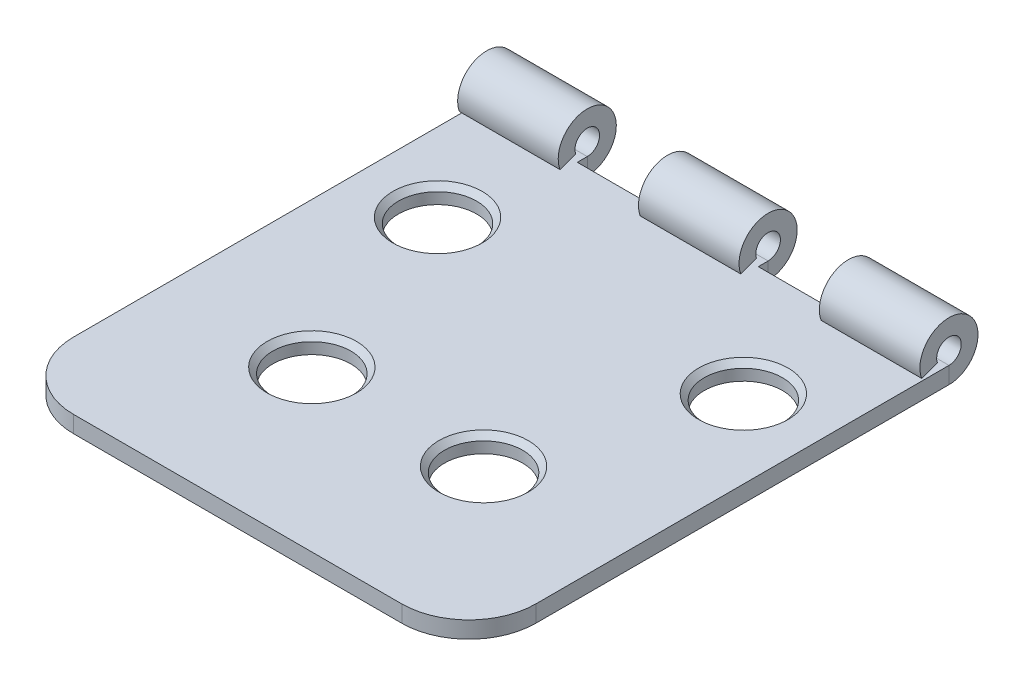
ISO-10303-21;
HEADER;
FILE_DESCRIPTION(('STEP AP214'),'2;1');
FILE_NAME('part.step','',(''),(''),'','','');
FILE_SCHEMA(('AUTOMOTIVE_DESIGN { 1 0 10303 214 1 1 1 1 }'));
ENDSEC;
DATA;
#1=APPLICATION_CONTEXT('core data for automotive mechanical design processes');
#2=APPLICATION_PROTOCOL_DEFINITION('international standard','automotive_design',2000,#1);
#3=PRODUCT_CONTEXT('',#1,'mechanical');
#4=PRODUCT('Part','Part','',(#3));
#5=PRODUCT_RELATED_PRODUCT_CATEGORY('part','',(#4));
#6=PRODUCT_DEFINITION_FORMATION('','',#4);
#7=PRODUCT_DEFINITION_CONTEXT('part definition',#1,'design');
#8=PRODUCT_DEFINITION('design','',#6,#7);
#9=PRODUCT_DEFINITION_SHAPE('','',#8);
#10=(LENGTH_UNIT() NAMED_UNIT(*) SI_UNIT(.MILLI.,.METRE.));
#11=(NAMED_UNIT(*) PLANE_ANGLE_UNIT() SI_UNIT($,.RADIAN.));
#12=(NAMED_UNIT(*) SI_UNIT($,.STERADIAN.) SOLID_ANGLE_UNIT());
#13=UNCERTAINTY_MEASURE_WITH_UNIT(LENGTH_MEASURE(1.E-05),#10,'distance_accuracy_value','');
#14=(GEOMETRIC_REPRESENTATION_CONTEXT(3) GLOBAL_UNCERTAINTY_ASSIGNED_CONTEXT((#13)) GLOBAL_UNIT_ASSIGNED_CONTEXT((#10,
#11,#12)) REPRESENTATION_CONTEXT('',''));
#15=CARTESIAN_POINT('',(0.,0.,0.));
#16=DIRECTION('',(0.,0.,1.));
#17=DIRECTION('',(1.,0.,0.));
#18=AXIS2_PLACEMENT_3D('',#15,#16,#17);
#19=CARTESIAN_POINT('',(9.57958122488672,-0.484575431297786,-6.62388353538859));
#20=DIRECTION('',(0.,1.,0.));
#21=DIRECTION('',(0.,0.,1.));
#22=AXIS2_PLACEMENT_3D('',#19,#20,#21);
#23=CONICAL_SURFACE('',#22,2.45,0.785398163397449);
#24=CARTESIAN_POINT('',(9.57958122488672,-0.134575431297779,-6.62388353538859));
#25=DIRECTION('',(0.,-1.,0.));
#26=DIRECTION('',(0.,0.,-1.));
#27=AXIS2_PLACEMENT_3D('',#24,#25,#26);
#28=CIRCLE('',#27,2.80000000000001);
#29=CARTESIAN_POINT('',(9.57958122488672,-0.134575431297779,-9.4238835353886));
#30=VERTEX_POINT('',#29);
#31=EDGE_CURVE('E321',#30,#30,#28,.T.);
#32=ORIENTED_EDGE('',*,*,#31,.F.);
#33=EDGE_LOOP('',(#32));
#34=FACE_BOUND('',#33,.T.);
#35=CARTESIAN_POINT('',(9.57958122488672,-0.484575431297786,-6.62388353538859));
#36=DIRECTION('',(0.,-1.,0.));
#37=DIRECTION('',(0.,0.,-1.));
#38=AXIS2_PLACEMENT_3D('',#35,#36,#37);
#39=CIRCLE('',#38,2.45);
#40=CARTESIAN_POINT('',(9.57958122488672,-0.484575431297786,-9.07388353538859));
#41=VERTEX_POINT('',#40);
#42=EDGE_CURVE('E386',#41,#41,#39,.F.);
#43=ORIENTED_EDGE('',*,*,#42,.F.);
#44=EDGE_LOOP('',(#43));
#45=FACE_BOUND('',#44,.T.);
#46=ADVANCED_FACE('F54',(#34,#45),#23,.F.);
#47=CARTESIAN_POINT('',(5.37958122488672,-0.484575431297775,5.45125859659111));
#48=DIRECTION('',(0.,1.,0.));
#49=DIRECTION('',(0.,0.,1.));
#50=AXIS2_PLACEMENT_3D('',#47,#48,#49);
#51=CONICAL_SURFACE('',#50,2.45,0.78539816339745);
#52=CARTESIAN_POINT('',(5.37958122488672,-0.134575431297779,5.45125859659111));
#53=DIRECTION('',(0.,-1.,0.));
#54=DIRECTION('',(0.,0.,-1.));
#55=AXIS2_PLACEMENT_3D('',#52,#53,#54);
#56=CIRCLE('',#55,2.8);
#57=CARTESIAN_POINT('',(5.37958122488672,-0.134575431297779,2.65125859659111));
#58=VERTEX_POINT('',#57);
#59=EDGE_CURVE('E324',#58,#58,#56,.T.);
#60=ORIENTED_EDGE('',*,*,#59,.F.);
#61=EDGE_LOOP('',(#60));
#62=FACE_BOUND('',#61,.T.);
#63=CARTESIAN_POINT('',(5.37958122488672,-0.484575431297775,5.45125859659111));
#64=DIRECTION('',(0.,-1.,0.));
#65=DIRECTION('',(0.,0.,-1.));
#66=AXIS2_PLACEMENT_3D('',#63,#64,#65);
#67=CIRCLE('',#66,2.45);
#68=CARTESIAN_POINT('',(5.37958122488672,-0.484575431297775,3.00125859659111));
#69=VERTEX_POINT('',#68);
#70=EDGE_CURVE('E389',#69,#69,#67,.F.);
#71=ORIENTED_EDGE('',*,*,#70,.F.);
#72=EDGE_LOOP('',(#71));
#73=FACE_BOUND('',#72,.T.);
#74=ADVANCED_FACE('F442',(#62,#73),#51,.F.);
#75=CARTESIAN_POINT('',(-5.37941877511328,-0.484575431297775,5.45125859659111));
#76=DIRECTION('',(0.,1.,0.));
#77=DIRECTION('',(0.,0.,1.));
#78=AXIS2_PLACEMENT_3D('',#75,#76,#77);
#79=CONICAL_SURFACE('',#78,2.45,0.78539816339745);
#80=CARTESIAN_POINT('',(-5.37941877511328,-0.134575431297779,5.45125859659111));
#81=DIRECTION('',(0.,-1.,0.));
#82=DIRECTION('',(0.,0.,-1.));
#83=AXIS2_PLACEMENT_3D('',#80,#81,#82);
#84=CIRCLE('',#83,2.8);
#85=CARTESIAN_POINT('',(-5.37941877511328,-0.134575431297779,2.65125859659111));
#86=VERTEX_POINT('',#85);
#87=EDGE_CURVE('E327',#86,#86,#84,.T.);
#88=ORIENTED_EDGE('',*,*,#87,.F.);
#89=EDGE_LOOP('',(#88));
#90=FACE_BOUND('',#89,.T.);
#91=CARTESIAN_POINT('',(-5.37941877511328,-0.484575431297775,5.45125859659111));
#92=DIRECTION('',(0.,-1.,0.));
#93=DIRECTION('',(0.,0.,-1.));
#94=AXIS2_PLACEMENT_3D('',#91,#92,#93);
#95=CIRCLE('',#94,2.45);
#96=CARTESIAN_POINT('',(-5.37941877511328,-0.484575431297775,3.00125859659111));
#97=VERTEX_POINT('',#96);
#98=EDGE_CURVE('E392',#97,#97,#95,.F.);
#99=ORIENTED_EDGE('',*,*,#98,.F.);
#100=EDGE_LOOP('',(#99));
#101=FACE_BOUND('',#100,.T.);
#102=ADVANCED_FACE('F448',(#90,#101),#79,.F.);
#103=CARTESIAN_POINT('',(-9.57941877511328,-0.484575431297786,-6.62388353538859));
#104=DIRECTION('',(0.,1.,0.));
#105=DIRECTION('',(0.,0.,1.));
#106=AXIS2_PLACEMENT_3D('',#103,#104,#105);
#107=CONICAL_SURFACE('',#106,2.45,0.785398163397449);
#108=CARTESIAN_POINT('',(-9.57941877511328,-0.134575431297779,-6.62388353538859));
#109=DIRECTION('',(0.,-1.,0.));
#110=DIRECTION('',(0.,0.,-1.));
#111=AXIS2_PLACEMENT_3D('',#108,#109,#110);
#112=CIRCLE('',#111,2.80000000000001);
#113=CARTESIAN_POINT('',(-9.57941877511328,-0.134575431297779,-9.4238835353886));
#114=VERTEX_POINT('',#113);
#115=EDGE_CURVE('E330',#114,#114,#112,.T.);
#116=ORIENTED_EDGE('',*,*,#115,.F.);
#117=EDGE_LOOP('',(#116));
#118=FACE_BOUND('',#117,.T.);
#119=CARTESIAN_POINT('',(-9.57941877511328,-0.484575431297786,-6.62388353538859));
#120=DIRECTION('',(0.,-1.,0.));
#121=DIRECTION('',(0.,0.,-1.));
#122=AXIS2_PLACEMENT_3D('',#119,#120,#121);
#123=CIRCLE('',#122,2.45);
#124=CARTESIAN_POINT('',(-9.57941877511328,-0.484575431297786,-9.07388353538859));
#125=VERTEX_POINT('',#124);
#126=EDGE_CURVE('E395',#125,#125,#123,.F.);
#127=ORIENTED_EDGE('',*,*,#126,.F.);
#128=EDGE_LOOP('',(#127));
#129=FACE_BOUND('',#128,.T.);
#130=ADVANCED_FACE('F459',(#118,#129),#107,.F.);
#131=CARTESIAN_POINT('',(-9.57941877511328,-1.18457543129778,-6.62388353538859));
#132=DIRECTION('',(0.,1.,0.));
#133=DIRECTION('',(0.,0.,1.));
#134=AXIS2_PLACEMENT_3D('',#131,#132,#133);
#135=CYLINDRICAL_SURFACE('',#134,2.45);
#136=ORIENTED_EDGE('',*,*,#126,.T.);
#137=EDGE_LOOP('',(#136));
#138=FACE_BOUND('',#137,.T.);
#139=CARTESIAN_POINT('',(-9.57941877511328,-1.18457543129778,-6.62388353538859));
#140=DIRECTION('',(0.,1.,0.));
#141=DIRECTION('',(0.,0.,1.));
#142=AXIS2_PLACEMENT_3D('',#139,#140,#141);
#143=CIRCLE('',#142,2.45);
#144=CARTESIAN_POINT('',(-9.57941877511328,-1.18457543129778,-4.17388353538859));
#145=VERTEX_POINT('',#144);
#146=EDGE_CURVE('E339',#145,#145,#143,.T.);
#147=ORIENTED_EDGE('',*,*,#146,.F.);
#148=EDGE_LOOP('',(#147));
#149=FACE_BOUND('',#148,.T.);
#150=ADVANCED_FACE('F463',(#138,#149),#135,.F.);
#151=CARTESIAN_POINT('',(-5.37941877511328,-1.18457543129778,5.45125859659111));
#152=DIRECTION('',(0.,1.,0.));
#153=DIRECTION('',(0.,0.,1.));
#154=AXIS2_PLACEMENT_3D('',#151,#152,#153);
#155=CYLINDRICAL_SURFACE('',#154,2.45);
#156=ORIENTED_EDGE('',*,*,#98,.T.);
#157=EDGE_LOOP('',(#156));
#158=FACE_BOUND('',#157,.T.);
#159=CARTESIAN_POINT('',(-5.37941877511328,-1.18457543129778,5.45125859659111));
#160=DIRECTION('',(0.,1.,0.));
#161=DIRECTION('',(0.,0.,1.));
#162=AXIS2_PLACEMENT_3D('',#159,#160,#161);
#163=CIRCLE('',#162,2.45);
#164=CARTESIAN_POINT('',(-5.37941877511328,-1.18457543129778,7.90125859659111));
#165=VERTEX_POINT('',#164);
#166=EDGE_CURVE('E342',#165,#165,#163,.T.);
#167=ORIENTED_EDGE('',*,*,#166,.F.);
#168=EDGE_LOOP('',(#167));
#169=FACE_BOUND('',#168,.T.);
#170=ADVANCED_FACE('F467',(#158,#169),#155,.F.);
#171=CARTESIAN_POINT('',(5.37958122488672,-1.18457543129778,5.45125859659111));
#172=DIRECTION('',(0.,1.,0.));
#173=DIRECTION('',(0.,0.,1.));
#174=AXIS2_PLACEMENT_3D('',#171,#172,#173);
#175=CYLINDRICAL_SURFACE('',#174,2.45);
#176=ORIENTED_EDGE('',*,*,#70,.T.);
#177=EDGE_LOOP('',(#176));
#178=FACE_BOUND('',#177,.T.);
#179=CARTESIAN_POINT('',(5.37958122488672,-1.18457543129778,5.45125859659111));
#180=DIRECTION('',(0.,1.,0.));
#181=DIRECTION('',(0.,0.,-1.));
#182=AXIS2_PLACEMENT_3D('',#179,#180,#181);
#183=CIRCLE('',#182,2.45);
#184=CARTESIAN_POINT('',(5.37958122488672,-1.18457543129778,3.00125859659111));
#185=VERTEX_POINT('',#184);
#186=EDGE_CURVE('E345',#185,#185,#183,.T.);
#187=ORIENTED_EDGE('',*,*,#186,.F.);
#188=EDGE_LOOP('',(#187));
#189=FACE_BOUND('',#188,.T.);
#190=ADVANCED_FACE('F471',(#178,#189),#175,.F.);
#191=CARTESIAN_POINT('',(9.57958122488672,-1.18457543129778,-6.62388353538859));
#192=DIRECTION('',(0.,1.,0.));
#193=DIRECTION('',(0.,0.,1.));
#194=AXIS2_PLACEMENT_3D('',#191,#192,#193);
#195=CYLINDRICAL_SURFACE('',#194,2.45);
#196=ORIENTED_EDGE('',*,*,#42,.T.);
#197=EDGE_LOOP('',(#196));
#198=FACE_BOUND('',#197,.T.);
#199=CARTESIAN_POINT('',(9.57958122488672,-1.18457543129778,-6.62388353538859));
#200=DIRECTION('',(0.,1.,0.));
#201=DIRECTION('',(0.,0.,-1.));
#202=AXIS2_PLACEMENT_3D('',#199,#200,#201);
#203=CIRCLE('',#202,2.45);
#204=CARTESIAN_POINT('',(9.57958122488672,-1.18457543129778,-9.07388353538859));
#205=VERTEX_POINT('',#204);
#206=EDGE_CURVE('E348',#205,#205,#203,.T.);
#207=ORIENTED_EDGE('',*,*,#206,.F.);
#208=EDGE_LOOP('',(#207));
#209=FACE_BOUND('',#208,.T.);
#210=ADVANCED_FACE('F475',(#198,#209),#195,.F.);
#211=CARTESIAN_POINT('',(-8.1794187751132,-3.63457543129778,-13.9811088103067));
#212=DIRECTION('',(0.,0.,1.));
#213=DIRECTION('',(1.,0.,0.));
#214=AXIS2_PLACEMENT_3D('',#211,#212,#213);
#215=PLANE('',#214);
#216=DIRECTION('',(-1.,0.,0.));
#217=VECTOR('',#216,1.);
#218=CARTESIAN_POINT('',(-10.2794187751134,-1.18457543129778,-13.9811088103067));
#219=LINE('',#218,#217);
#220=CARTESIAN_POINT('',(-3.14991877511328,-1.18457543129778,-13.9811088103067));
#221=VERTEX_POINT('',#220);
#222=CARTESIAN_POINT('',(-8.1794187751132,-1.18457543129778,-13.9811088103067));
#223=VERTEX_POINT('',#222);
#224=EDGE_CURVE('E384',#221,#223,#219,.T.);
#225=ORIENTED_EDGE('',*,*,#224,.T.);
#226=DIRECTION('',(0.,1.,0.));
#227=VECTOR('',#226,1.);
#228=CARTESIAN_POINT('',(-8.1794187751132,-3.63457543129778,-13.9811088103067));
#229=LINE('',#228,#227);
#230=CARTESIAN_POINT('',(-8.1794187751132,-0.134575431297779,-13.9811088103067));
#231=VERTEX_POINT('',#230);
#232=EDGE_CURVE('E382',#223,#231,#229,.T.);
#233=ORIENTED_EDGE('',*,*,#232,.T.);
#234=DIRECTION('',(1.,0.,0.));
#235=VECTOR('',#234,1.);
#236=CARTESIAN_POINT('',(-8.1794187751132,-0.134575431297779,-13.9811088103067));
#237=LINE('',#236,#235);
#238=CARTESIAN_POINT('',(-3.14991877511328,-0.134575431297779,-13.9811088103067));
#239=VERTEX_POINT('',#238);
#240=EDGE_CURVE('E379',#231,#239,#237,.T.);
#241=ORIENTED_EDGE('',*,*,#240,.T.);
#242=DIRECTION('',(0.,1.,0.));
#243=VECTOR('',#242,1.);
#244=CARTESIAN_POINT('',(-3.14991877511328,-3.63457543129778,-13.9811088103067));
#245=LINE('',#244,#243);
#246=EDGE_CURVE('E305',#221,#239,#245,.T.);
#247=ORIENTED_EDGE('',*,*,#246,.F.);
#248=EDGE_LOOP('',(#225,#233,#241,#247));
#249=FACE_BOUND('',#248,.T.);
#250=ADVANCED_FACE('F479',(#249),#215,.F.);
#251=CARTESIAN_POINT('',(-10.2794187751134,-1.18457543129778,11.2751164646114));
#252=DIRECTION('',(0.,1.,0.));
#253=DIRECTION('',(0.,0.,1.));
#254=AXIS2_PLACEMENT_3D('',#251,#252,#253);
#255=CYLINDRICAL_SURFACE('',#254,4.2);
#256=CARTESIAN_POINT('',(-10.2794187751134,-0.134575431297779,11.2751164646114));
#257=DIRECTION('',(0.,1.,0.));
#258=DIRECTION('',(0.,0.,-1.));
#259=AXIS2_PLACEMENT_3D('',#256,#257,#258);
#260=CIRCLE('',#259,4.2);
#261=CARTESIAN_POINT('',(-14.4794187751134,-0.134575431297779,11.2751164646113));
#262=VERTEX_POINT('',#261);
#263=CARTESIAN_POINT('',(-10.2794187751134,-0.134575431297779,15.4751164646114));
#264=VERTEX_POINT('',#263);
#265=EDGE_CURVE('E317',#262,#264,#260,.T.);
#266=ORIENTED_EDGE('',*,*,#265,.F.);
#267=DIRECTION('',(0.,1.,0.));
#268=VECTOR('',#267,1.);
#269=CARTESIAN_POINT('',(-14.4794187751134,-1.18457543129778,11.2751164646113));
#270=LINE('',#269,#268);
#271=CARTESIAN_POINT('',(-14.4794187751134,-1.18457543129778,11.2751164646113));
#272=VERTEX_POINT('',#271);
#273=EDGE_CURVE('E12',#272,#262,#270,.T.);
#274=ORIENTED_EDGE('',*,*,#273,.F.);
#275=CARTESIAN_POINT('',(-10.2794187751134,-1.18457543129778,11.2751164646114));
#276=DIRECTION('',(0.,1.,0.));
#277=DIRECTION('',(0.,0.,-1.));
#278=AXIS2_PLACEMENT_3D('',#275,#276,#277);
#279=CIRCLE('',#278,4.2);
#280=CARTESIAN_POINT('',(-10.2794187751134,-1.18457543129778,15.4751164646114));
#281=VERTEX_POINT('',#280);
#282=EDGE_CURVE('E376',#272,#281,#279,.T.);
#283=ORIENTED_EDGE('',*,*,#282,.T.);
#284=DIRECTION('',(0.,1.,0.));
#285=VECTOR('',#284,1.);
#286=CARTESIAN_POINT('',(-10.2794187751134,-1.18457543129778,15.4751164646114));
#287=LINE('',#286,#285);
#288=EDGE_CURVE('E374',#281,#264,#287,.T.);
#289=ORIENTED_EDGE('',*,*,#288,.T.);
#290=EDGE_LOOP('',(#266,#274,#283,#289));
#291=FACE_BOUND('',#290,.T.);
#292=ADVANCED_FACE('F483',(#291),#255,.T.);
#293=CARTESIAN_POINT('',(-10.2794187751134,-1.18457543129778,15.4751164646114));
#294=DIRECTION('',(0.,0.,1.));
#295=DIRECTION('',(1.,0.,0.));
#296=AXIS2_PLACEMENT_3D('',#293,#294,#295);
#297=PLANE('',#296);
#298=DIRECTION('',(1.,0.,0.));
#299=VECTOR('',#298,1.);
#300=CARTESIAN_POINT('',(-10.2794187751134,-0.134575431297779,15.4751164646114));
#301=LINE('',#300,#299);
#302=CARTESIAN_POINT('',(10.2795812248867,-0.134575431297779,15.4751164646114));
#303=VERTEX_POINT('',#302);
#304=EDGE_CURVE('E314',#264,#303,#301,.T.);
#305=ORIENTED_EDGE('',*,*,#304,.F.);
#306=ORIENTED_EDGE('',*,*,#288,.F.);
#307=DIRECTION('',(1.,0.,0.));
#308=VECTOR('',#307,1.);
#309=CARTESIAN_POINT('',(-10.2794187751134,-1.18457543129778,15.4751164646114));
#310=LINE('',#309,#308);
#311=CARTESIAN_POINT('',(10.2795812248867,-1.18457543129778,15.4751164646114));
#312=VERTEX_POINT('',#311);
#313=EDGE_CURVE('E371',#281,#312,#310,.T.);
#314=ORIENTED_EDGE('',*,*,#313,.T.);
#315=DIRECTION('',(0.,1.,0.));
#316=VECTOR('',#315,1.);
#317=CARTESIAN_POINT('',(10.2795812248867,-1.18457543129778,15.4751164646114));
#318=LINE('',#317,#316);
#319=EDGE_CURVE('E369',#312,#303,#318,.T.);
#320=ORIENTED_EDGE('',*,*,#319,.T.);
#321=EDGE_LOOP('',(#305,#306,#314,#320));
#322=FACE_BOUND('',#321,.T.);
#323=ADVANCED_FACE('F487',(#322),#297,.T.);
#324=CARTESIAN_POINT('',(10.2795812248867,-1.18457543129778,11.2751164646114));
#325=DIRECTION('',(0.,1.,0.));
#326=DIRECTION('',(0.,0.,1.));
#327=AXIS2_PLACEMENT_3D('',#324,#325,#326);
#328=CYLINDRICAL_SURFACE('',#327,4.2);
#329=CARTESIAN_POINT('',(10.2795812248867,-0.134575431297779,11.2751164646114));
#330=DIRECTION('',(0.,1.,0.));
#331=DIRECTION('',(0.,0.,1.));
#332=AXIS2_PLACEMENT_3D('',#329,#330,#331);
#333=CIRCLE('',#332,4.2);
#334=CARTESIAN_POINT('',(14.4795812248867,-0.134575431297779,11.2751164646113));
#335=VERTEX_POINT('',#334);
#336=EDGE_CURVE('E311',#303,#335,#333,.T.);
#337=ORIENTED_EDGE('',*,*,#336,.F.);
#338=ORIENTED_EDGE('',*,*,#319,.F.);
#339=CARTESIAN_POINT('',(10.2795812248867,-1.18457543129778,11.2751164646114));
#340=DIRECTION('',(0.,1.,0.));
#341=DIRECTION('',(0.,0.,1.));
#342=AXIS2_PLACEMENT_3D('',#339,#340,#341);
#343=CIRCLE('',#342,4.2);
#344=CARTESIAN_POINT('',(14.4795812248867,-1.18457543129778,11.2751164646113));
#345=VERTEX_POINT('',#344);
#346=EDGE_CURVE('E366',#312,#345,#343,.T.);
#347=ORIENTED_EDGE('',*,*,#346,.T.);
#348=DIRECTION('',(0.,1.,0.));
#349=VECTOR('',#348,1.);
#350=CARTESIAN_POINT('',(14.4795812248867,-1.18457543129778,11.2751164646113));
#351=LINE('',#350,#349);
#352=EDGE_CURVE('E364',#345,#335,#351,.T.);
#353=ORIENTED_EDGE('',*,*,#352,.T.);
#354=EDGE_LOOP('',(#337,#338,#347,#353));
#355=FACE_BOUND('',#354,.T.);
#356=ADVANCED_FACE('F491',(#355),#328,.T.);
#357=CARTESIAN_POINT('',(3.15008122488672,-3.63457543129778,-13.987108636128));
#358=DIRECTION('',(0.,0.,1.));
#359=DIRECTION('',(1.,0.,0.));
#360=AXIS2_PLACEMENT_3D('',#357,#358,#359);
#361=PLANE('',#360);
#362=DIRECTION('',(-1.,0.,0.));
#363=VECTOR('',#362,1.);
#364=CARTESIAN_POINT('',(-10.2794187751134,-1.18457543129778,-13.987108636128));
#365=LINE('',#364,#363);
#366=CARTESIAN_POINT('',(8.17958122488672,-1.18457543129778,-13.987108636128));
#367=VERTEX_POINT('',#366);
#368=CARTESIAN_POINT('',(3.15008122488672,-1.18457543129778,-13.987108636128));
#369=VERTEX_POINT('',#368);
#370=EDGE_CURVE('E362',#367,#369,#365,.T.);
#371=ORIENTED_EDGE('',*,*,#370,.T.);
#372=DIRECTION('',(0.,1.,0.));
#373=VECTOR('',#372,1.);
#374=CARTESIAN_POINT('',(3.15008122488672,-3.63457543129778,-13.987108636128));
#375=LINE('',#374,#373);
#376=CARTESIAN_POINT('',(3.15008122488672,-0.134575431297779,-13.987108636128));
#377=VERTEX_POINT('',#376);
#378=EDGE_CURVE('E360',#369,#377,#375,.T.);
#379=ORIENTED_EDGE('',*,*,#378,.T.);
#380=DIRECTION('',(1.,0.,0.));
#381=VECTOR('',#380,1.);
#382=CARTESIAN_POINT('',(3.15008122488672,-0.134575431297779,-13.987108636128));
#383=LINE('',#382,#381);
#384=CARTESIAN_POINT('',(8.17958122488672,-0.134575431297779,-13.987108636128));
#385=VERTEX_POINT('',#384);
#386=EDGE_CURVE('E357',#377,#385,#383,.T.);
#387=ORIENTED_EDGE('',*,*,#386,.T.);
#388=DIRECTION('',(0.,1.,0.));
#389=VECTOR('',#388,1.);
#390=CARTESIAN_POINT('',(8.17958122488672,-3.63457543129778,-13.987108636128));
#391=LINE('',#390,#389);
#392=EDGE_CURVE('E298',#367,#385,#391,.T.);
#393=ORIENTED_EDGE('',*,*,#392,.F.);
#394=EDGE_LOOP('',(#371,#379,#387,#393));
#395=FACE_BOUND('',#394,.T.);
#396=ADVANCED_FACE('F495',(#395),#361,.F.);
#397=CARTESIAN_POINT('',(-10.2794187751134,-1.18457543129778,11.2751164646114));
#398=DIRECTION('',(0.,-1.,0.));
#399=DIRECTION('',(0.,0.,-1.));
#400=AXIS2_PLACEMENT_3D('',#397,#398,#399);
#401=PLANE('',#400);
#402=DIRECTION('',(0.,0.,-1.));
#403=VECTOR('',#402,1.);
#404=CARTESIAN_POINT('',(3.15008122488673,-1.18457543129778,11.2751164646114));
#405=LINE('',#404,#403);
#406=CARTESIAN_POINT('',(3.15008122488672,-1.18457543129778,-14.6038835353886));
#407=VERTEX_POINT('',#406);
#408=EDGE_CURVE('E333',#369,#407,#405,.T.);
#409=ORIENTED_EDGE('',*,*,#408,.F.);
#410=ORIENTED_EDGE('',*,*,#370,.F.);
#411=DIRECTION('',(0.,0.,1.));
#412=VECTOR('',#411,1.);
#413=CARTESIAN_POINT('',(8.17958122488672,-1.18457543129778,11.2751164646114));
#414=LINE('',#413,#412);
#415=CARTESIAN_POINT('',(8.17958122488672,-1.18457543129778,-14.6038835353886));
#416=VERTEX_POINT('',#415);
#417=EDGE_CURVE('E300',#416,#367,#414,.T.);
#418=ORIENTED_EDGE('',*,*,#417,.F.);
#419=DIRECTION('',(1.,0.,0.));
#420=VECTOR('',#419,1.);
#421=CARTESIAN_POINT('',(-14.4794187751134,-1.18457543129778,-14.6038835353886));
#422=LINE('',#421,#420);
#423=CARTESIAN_POINT('',(14.4795812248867,-1.18457543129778,-14.6038835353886));
#424=VERTEX_POINT('',#423);
#425=EDGE_CURVE('E355',#416,#424,#422,.T.);
#426=ORIENTED_EDGE('',*,*,#425,.T.);
#427=DIRECTION('',(0.,0.,-1.));
#428=VECTOR('',#427,1.);
#429=CARTESIAN_POINT('',(14.4795812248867,-1.18457543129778,11.2751164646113));
#430=LINE('',#429,#428);
#431=EDGE_CURVE('E155',#345,#424,#430,.T.);
#432=ORIENTED_EDGE('',*,*,#431,.F.);
#433=ORIENTED_EDGE('',*,*,#346,.F.);
#434=ORIENTED_EDGE('',*,*,#313,.F.);
#435=ORIENTED_EDGE('',*,*,#282,.F.);
#436=DIRECTION('',(0.,0.,1.));
#437=VECTOR('',#436,1.);
#438=CARTESIAN_POINT('',(-14.4794187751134,-1.18457543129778,11.2751164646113));
#439=LINE('',#438,#437);
#440=CARTESIAN_POINT('',(-14.4794187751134,-1.18457543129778,-14.6038835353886));
#441=VERTEX_POINT('',#440);
#442=EDGE_CURVE('E64',#441,#272,#439,.T.);
#443=ORIENTED_EDGE('',*,*,#442,.F.);
#444=DIRECTION('',(1.,0.,0.));
#445=VECTOR('',#444,1.);
#446=CARTESIAN_POINT('',(-14.4794187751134,-1.18457543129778,-14.6038835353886));
#447=LINE('',#446,#445);
#448=CARTESIAN_POINT('',(-8.1794187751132,-1.18457543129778,-14.6038835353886));
#449=VERTEX_POINT('',#448);
#450=EDGE_CURVE('E353',#441,#449,#447,.T.);
#451=ORIENTED_EDGE('',*,*,#450,.T.);
#452=DIRECTION('',(0.,0.,-1.));
#453=VECTOR('',#452,1.);
#454=CARTESIAN_POINT('',(-8.1794187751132,-1.18457543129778,11.2751164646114));
#455=LINE('',#454,#453);
#456=EDGE_CURVE('E290',#223,#449,#455,.T.);
#457=ORIENTED_EDGE('',*,*,#456,.F.);
#458=ORIENTED_EDGE('',*,*,#224,.F.);
#459=DIRECTION('',(0.,0.,1.));
#460=VECTOR('',#459,1.);
#461=CARTESIAN_POINT('',(-3.14991877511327,-1.18457543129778,11.2751164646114));
#462=LINE('',#461,#460);
#463=CARTESIAN_POINT('',(-3.14991877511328,-1.18457543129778,-14.6038835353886));
#464=VERTEX_POINT('',#463);
#465=EDGE_CURVE('E307',#464,#221,#462,.T.);
#466=ORIENTED_EDGE('',*,*,#465,.F.);
#467=DIRECTION('',(1.,0.,0.));
#468=VECTOR('',#467,1.);
#469=CARTESIAN_POINT('',(-14.4794187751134,-1.18457543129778,-14.6038835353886));
#470=LINE('',#469,#468);
#471=EDGE_CURVE('E351',#464,#407,#470,.T.);
#472=ORIENTED_EDGE('',*,*,#471,.T.);
#473=EDGE_LOOP('',(#409,#410,#418,#426,#432,#433,#434,#435,#443,#451,#457,#458,#466,#472));
#474=FACE_BOUND('',#473,.T.);
#475=ORIENTED_EDGE('',*,*,#206,.T.);
#476=EDGE_LOOP('',(#475));
#477=FACE_BOUND('',#476,.T.);
#478=ORIENTED_EDGE('',*,*,#186,.T.);
#479=EDGE_LOOP('',(#478));
#480=FACE_BOUND('',#479,.T.);
#481=ORIENTED_EDGE('',*,*,#166,.T.);
#482=EDGE_LOOP('',(#481));
#483=FACE_BOUND('',#482,.T.);
#484=ORIENTED_EDGE('',*,*,#146,.T.);
#485=EDGE_LOOP('',(#484));
#486=FACE_BOUND('',#485,.T.);
#487=ADVANCED_FACE('F499',(#474,#477,#480,#483,#486),#401,.T.);
#488=CARTESIAN_POINT('',(3.15008122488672,-3.63457543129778,-21.1584675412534));
#489=DIRECTION('',(-1.,0.,0.));
#490=DIRECTION('',(0.,0.,1.));
#491=AXIS2_PLACEMENT_3D('',#488,#489,#490);
#492=PLANE('',#491);
#493=DIRECTION('',(0.,-1.,0.));
#494=VECTOR('',#493,1.);
#495=CARTESIAN_POINT('',(3.15008122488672,-0.134575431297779,-14.6038835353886));
#496=LINE('',#495,#494);
#497=CARTESIAN_POINT('',(3.15008122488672,-0.134575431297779,-14.6038835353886));
#498=VERTEX_POINT('',#497);
#499=EDGE_CURVE('E235',#498,#407,#496,.T.);
#500=ORIENTED_EDGE('',*,*,#499,.F.);
#501=DIRECTION('',(0.,0.,1.));
#502=VECTOR('',#501,1.);
#503=CARTESIAN_POINT('',(3.15008122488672,-0.134575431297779,-21.1584675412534));
#504=LINE('',#503,#502);
#505=EDGE_CURVE('E336',#498,#377,#504,.T.);
#506=ORIENTED_EDGE('',*,*,#505,.T.);
#507=ORIENTED_EDGE('',*,*,#378,.F.);
#508=ORIENTED_EDGE('',*,*,#408,.T.);
#509=EDGE_LOOP('',(#500,#506,#507,#508));
#510=FACE_BOUND('',#509,.T.);
#511=ADVANCED_FACE('F503',(#510),#492,.F.);
#512=CARTESIAN_POINT('',(-10.2794187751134,-0.134575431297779,11.2751164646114));
#513=DIRECTION('',(0.,-1.,0.));
#514=DIRECTION('',(0.,0.,-1.));
#515=AXIS2_PLACEMENT_3D('',#512,#513,#514);
#516=PLANE('',#515);
#517=ORIENTED_EDGE('',*,*,#115,.T.);
#518=EDGE_LOOP('',(#517));
#519=FACE_BOUND('',#518,.T.);
#520=ORIENTED_EDGE('',*,*,#87,.T.);
#521=EDGE_LOOP('',(#520));
#522=FACE_BOUND('',#521,.T.);
#523=ORIENTED_EDGE('',*,*,#59,.T.);
#524=EDGE_LOOP('',(#523));
#525=FACE_BOUND('',#524,.T.);
#526=ORIENTED_EDGE('',*,*,#31,.T.);
#527=EDGE_LOOP('',(#526));
#528=FACE_BOUND('',#527,.T.);
#529=ORIENTED_EDGE('',*,*,#386,.F.);
#530=ORIENTED_EDGE('',*,*,#505,.F.);
#531=DIRECTION('',(1.,0.,0.));
#532=VECTOR('',#531,1.);
#533=CARTESIAN_POINT('',(-14.4794187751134,-0.134575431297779,-14.6038835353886));
#534=LINE('',#533,#532);
#535=CARTESIAN_POINT('',(-3.14991877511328,-0.134575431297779,-14.6038835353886));
#536=VERTEX_POINT('',#535);
#537=EDGE_CURVE('E399',#536,#498,#534,.T.);
#538=ORIENTED_EDGE('',*,*,#537,.F.);
#539=DIRECTION('',(0.,0.,-1.));
#540=VECTOR('',#539,1.);
#541=CARTESIAN_POINT('',(-3.14991877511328,-0.134575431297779,-21.1584675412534));
#542=LINE('',#541,#540);
#543=EDGE_CURVE('E303',#239,#536,#542,.T.);
#544=ORIENTED_EDGE('',*,*,#543,.F.);
#545=ORIENTED_EDGE('',*,*,#240,.F.);
#546=DIRECTION('',(0.,0.,1.));
#547=VECTOR('',#546,1.);
#548=CARTESIAN_POINT('',(-8.1794187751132,-0.134575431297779,-21.1584675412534));
#549=LINE('',#548,#547);
#550=CARTESIAN_POINT('',(-8.1794187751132,-0.134575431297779,-14.6038835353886));
#551=VERTEX_POINT('',#550);
#552=EDGE_CURVE('E293',#551,#231,#549,.T.);
#553=ORIENTED_EDGE('',*,*,#552,.F.);
#554=DIRECTION('',(1.,0.,0.));
#555=VECTOR('',#554,1.);
#556=CARTESIAN_POINT('',(-14.4794187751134,-0.134575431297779,-14.6038835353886));
#557=LINE('',#556,#555);
#558=CARTESIAN_POINT('',(-14.4794187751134,-0.134575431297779,-14.6038835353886));
#559=VERTEX_POINT('',#558);
#560=EDGE_CURVE('E58',#559,#551,#557,.T.);
#561=ORIENTED_EDGE('',*,*,#560,.F.);
#562=DIRECTION('',(0.,0.,1.));
#563=VECTOR('',#562,1.);
#564=CARTESIAN_POINT('',(-14.4794187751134,-0.134575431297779,11.2751164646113));
#565=LINE('',#564,#563);
#566=EDGE_CURVE('E143',#559,#262,#565,.T.);
#567=ORIENTED_EDGE('',*,*,#566,.T.);
#568=ORIENTED_EDGE('',*,*,#265,.T.);
#569=ORIENTED_EDGE('',*,*,#304,.T.);
#570=ORIENTED_EDGE('',*,*,#336,.T.);
#571=DIRECTION('',(0.,0.,-1.));
#572=VECTOR('',#571,1.);
#573=CARTESIAN_POINT('',(14.4795812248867,-0.134575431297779,11.2751164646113));
#574=LINE('',#573,#572);
#575=CARTESIAN_POINT('',(14.4795812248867,-0.134575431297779,-14.6038835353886));
#576=VERTEX_POINT('',#575);
#577=EDGE_CURVE('E309',#335,#576,#574,.T.);
#578=ORIENTED_EDGE('',*,*,#577,.T.);
#579=DIRECTION('',(1.,0.,0.));
#580=VECTOR('',#579,1.);
#581=CARTESIAN_POINT('',(-14.4794187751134,-0.134575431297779,-14.6038835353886));
#582=LINE('',#581,#580);
#583=CARTESIAN_POINT('',(8.17958122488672,-0.134575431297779,-14.6038835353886));
#584=VERTEX_POINT('',#583);
#585=EDGE_CURVE('E408',#584,#576,#582,.T.);
#586=ORIENTED_EDGE('',*,*,#585,.F.);
#587=DIRECTION('',(0.,0.,-1.));
#588=VECTOR('',#587,1.);
#589=CARTESIAN_POINT('',(8.17958122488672,-0.134575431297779,-21.1584675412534));
#590=LINE('',#589,#588);
#591=EDGE_CURVE('E296',#385,#584,#590,.T.);
#592=ORIENTED_EDGE('',*,*,#591,.F.);
#593=EDGE_LOOP('',(#529,#530,#538,#544,#545,#553,#561,#567,#568,#569,#570,#578,#586,#592));
#594=FACE_BOUND('',#593,.T.);
#595=ADVANCED_FACE('F506',(#519,#522,#525,#528,#594),#516,.F.);
#596=CARTESIAN_POINT('',(-3.14991877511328,-3.63457543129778,-21.1584675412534));
#597=DIRECTION('',(1.,0.,0.));
#598=DIRECTION('',(0.,0.,-1.));
#599=AXIS2_PLACEMENT_3D('',#596,#597,#598);
#600=PLANE('',#599);
#601=DIRECTION('',(0.,1.,0.));
#602=VECTOR('',#601,1.);
#603=CARTESIAN_POINT('',(-3.14991877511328,-1.18457543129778,-14.6038835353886));
#604=LINE('',#603,#602);
#605=EDGE_CURVE('E402',#464,#536,#604,.T.);
#606=ORIENTED_EDGE('',*,*,#605,.F.);
#607=ORIENTED_EDGE('',*,*,#465,.T.);
#608=ORIENTED_EDGE('',*,*,#246,.T.);
#609=ORIENTED_EDGE('',*,*,#543,.T.);
#610=EDGE_LOOP('',(#606,#607,#608,#609));
#611=FACE_BOUND('',#610,.T.);
#612=ADVANCED_FACE('F510',(#611),#600,.F.);
#613=CARTESIAN_POINT('',(14.4795812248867,-1.18457543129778,11.2751164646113));
#614=DIRECTION('',(1.,0.,0.));
#615=DIRECTION('',(0.,0.,-1.));
#616=AXIS2_PLACEMENT_3D('',#613,#614,#615);
#617=PLANE('',#616);
#618=DIRECTION('',(0.,-1.,0.));
#619=VECTOR('',#618,1.);
#620=CARTESIAN_POINT('',(14.4795812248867,-0.134575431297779,-14.6038835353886));
#621=LINE('',#620,#619);
#622=EDGE_CURVE('E405',#576,#424,#621,.T.);
#623=ORIENTED_EDGE('',*,*,#622,.F.);
#624=ORIENTED_EDGE('',*,*,#577,.F.);
#625=ORIENTED_EDGE('',*,*,#352,.F.);
#626=ORIENTED_EDGE('',*,*,#431,.T.);
#627=EDGE_LOOP('',(#623,#624,#625,#626));
#628=FACE_BOUND('',#627,.T.);
#629=ADVANCED_FACE('F514',(#628),#617,.T.);
#630=CARTESIAN_POINT('',(8.17958122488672,-3.63457543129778,-21.1584675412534));
#631=DIRECTION('',(1.,0.,0.));
#632=DIRECTION('',(0.,0.,-1.));
#633=AXIS2_PLACEMENT_3D('',#630,#631,#632);
#634=PLANE('',#633);
#635=DIRECTION('',(0.,1.,0.));
#636=VECTOR('',#635,1.);
#637=CARTESIAN_POINT('',(8.17958122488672,-1.18457543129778,-14.6038835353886));
#638=LINE('',#637,#636);
#639=EDGE_CURVE('E411',#416,#584,#638,.T.);
#640=ORIENTED_EDGE('',*,*,#639,.F.);
#641=ORIENTED_EDGE('',*,*,#417,.T.);
#642=ORIENTED_EDGE('',*,*,#392,.T.);
#643=ORIENTED_EDGE('',*,*,#591,.T.);
#644=EDGE_LOOP('',(#640,#641,#642,#643));
#645=FACE_BOUND('',#644,.T.);
#646=ADVANCED_FACE('F518',(#645),#634,.F.);
#647=CARTESIAN_POINT('',(-8.1794187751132,-3.63457543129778,-21.1584675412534));
#648=DIRECTION('',(-1.,0.,0.));
#649=DIRECTION('',(0.,0.,1.));
#650=AXIS2_PLACEMENT_3D('',#647,#648,#649);
#651=PLANE('',#650);
#652=DIRECTION('',(0.,-1.,0.));
#653=VECTOR('',#652,1.);
#654=CARTESIAN_POINT('',(-8.1794187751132,-0.134575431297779,-14.6038835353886));
#655=LINE('',#654,#653);
#656=EDGE_CURVE('E413',#551,#449,#655,.T.);
#657=ORIENTED_EDGE('',*,*,#656,.F.);
#658=ORIENTED_EDGE('',*,*,#552,.T.);
#659=ORIENTED_EDGE('',*,*,#232,.F.);
#660=ORIENTED_EDGE('',*,*,#456,.T.);
#661=EDGE_LOOP('',(#657,#658,#659,#660));
#662=FACE_BOUND('',#661,.T.);
#663=ADVANCED_FACE('F520',(#662),#651,.F.);
#664=CARTESIAN_POINT('',(-14.4794187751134,-1.18457543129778,11.2751164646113));
#665=DIRECTION('',(-1.,0.,0.));
#666=DIRECTION('',(0.,0.,1.));
#667=AXIS2_PLACEMENT_3D('',#664,#665,#666);
#668=PLANE('',#667);
#669=ORIENTED_EDGE('',*,*,#566,.F.);
#670=DIRECTION('',(0.,-1.,0.));
#671=VECTOR('',#670,1.);
#672=CARTESIAN_POINT('',(-14.4794187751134,-0.134575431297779,-14.6038835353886));
#673=LINE('',#672,#671);
#674=EDGE_CURVE('E288',#559,#441,#673,.T.);
#675=ORIENTED_EDGE('',*,*,#674,.T.);
#676=ORIENTED_EDGE('',*,*,#442,.T.);
#677=ORIENTED_EDGE('',*,*,#273,.T.);
#678=EDGE_LOOP('',(#669,#675,#676,#677));
#679=FACE_BOUND('',#678,.T.);
#680=ADVANCED_FACE('F56',(#679),#668,.T.);
#681=CARTESIAN_POINT('',(8.17958122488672,0.635424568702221,-14.6038835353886));
#682=DIRECTION('',(-1.,0.,0.));
#683=DIRECTION('',(0.,0.,1.));
#684=AXIS2_PLACEMENT_3D('',#681,#682,#683);
#685=PLANE('',#684);
#686=ORIENTED_EDGE('',*,*,#639,.T.);
#687=CARTESIAN_POINT('',(8.17958122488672,0.635424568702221,-14.6038835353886));
#688=DIRECTION('',(1.,0.,0.));
#689=DIRECTION('',(0.,0.,-1.));
#690=AXIS2_PLACEMENT_3D('',#687,#688,#689);
#691=CIRCLE('',#690,0.77);
#692=CARTESIAN_POINT('',(8.17958122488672,0.372069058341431,-13.8803202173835));
#693=VERTEX_POINT('',#692);
#694=EDGE_CURVE('E268',#584,#693,#691,.T.);
#695=ORIENTED_EDGE('',*,*,#694,.T.);
#696=DIRECTION('',(0.,-0.342020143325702,0.939692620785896));
#697=VECTOR('',#696,1.);
#698=CARTESIAN_POINT('',(8.17958122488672,0.0129479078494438,-12.8936429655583));
#699=LINE('',#698,#697);
#700=CARTESIAN_POINT('',(8.17958122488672,0.0129479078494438,-12.8936429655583));
#701=VERTEX_POINT('',#700);
#702=EDGE_CURVE('E174',#693,#701,#699,.T.);
#703=ORIENTED_EDGE('',*,*,#702,.T.);
#704=CARTESIAN_POINT('',(8.17958122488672,0.635424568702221,-14.6038835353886));
#705=DIRECTION('',(1.,0.,0.));
#706=DIRECTION('',(0.,0.,-1.));
#707=AXIS2_PLACEMENT_3D('',#704,#705,#706);
#708=CIRCLE('',#707,1.82);
#709=EDGE_CURVE('E270',#416,#701,#708,.T.);
#710=ORIENTED_EDGE('',*,*,#709,.F.);
#711=EDGE_LOOP('',(#686,#695,#703,#710));
#712=FACE_BOUND('',#711,.T.);
#713=ADVANCED_FACE('F454',(#712),#685,.T.);
#714=CARTESIAN_POINT('',(11.3295812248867,0.0129479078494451,-12.8936429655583));
#715=DIRECTION('',(0.,-0.939692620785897,-0.342020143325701));
#716=DIRECTION('',(1.,0.,0.));
#717=AXIS2_PLACEMENT_3D('',#714,#715,#716);
#718=PLANE('',#717);
#719=ORIENTED_EDGE('',*,*,#702,.F.);
#720=DIRECTION('',(1.,0.,0.));
#721=VECTOR('',#720,1.);
#722=CARTESIAN_POINT('',(2.17780153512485,0.372069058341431,-13.8803202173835));
#723=LINE('',#722,#721);
#724=CARTESIAN_POINT('',(14.4795812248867,0.372069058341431,-13.8803202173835));
#725=VERTEX_POINT('',#724);
#726=EDGE_CURVE('E281',#693,#725,#723,.T.);
#727=ORIENTED_EDGE('',*,*,#726,.T.);
#728=DIRECTION('',(0.,-0.342020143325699,0.939692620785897));
#729=VECTOR('',#728,1.);
#730=CARTESIAN_POINT('',(14.4795812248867,0.0129479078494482,-12.8936429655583));
#731=LINE('',#730,#729);
#732=CARTESIAN_POINT('',(14.4795812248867,0.0129479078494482,-12.8936429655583));
#733=VERTEX_POINT('',#732);
#734=EDGE_CURVE('E166',#725,#733,#731,.T.);
#735=ORIENTED_EDGE('',*,*,#734,.T.);
#736=DIRECTION('',(1.,0.,0.));
#737=VECTOR('',#736,1.);
#738=CARTESIAN_POINT('',(8.17958122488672,0.0129479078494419,-12.8936429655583));
#739=LINE('',#738,#737);
#740=EDGE_CURVE('E273',#701,#733,#739,.T.);
#741=ORIENTED_EDGE('',*,*,#740,.F.);
#742=EDGE_LOOP('',(#719,#727,#735,#741));
#743=FACE_BOUND('',#742,.T.);
#744=ADVANCED_FACE('F564',(#743),#718,.T.);
#745=CARTESIAN_POINT('',(14.4795812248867,0.635424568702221,-14.6038835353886));
#746=DIRECTION('',(1.,0.,0.));
#747=DIRECTION('',(0.,0.,-1.));
#748=AXIS2_PLACEMENT_3D('',#745,#746,#747);
#749=PLANE('',#748);
#750=ORIENTED_EDGE('',*,*,#734,.F.);
#751=CARTESIAN_POINT('',(14.4795812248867,0.635424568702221,-14.6038835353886));
#752=DIRECTION('',(1.,0.,0.));
#753=DIRECTION('',(0.,0.,-1.));
#754=AXIS2_PLACEMENT_3D('',#751,#752,#753);
#755=CIRCLE('',#754,0.77);
#756=EDGE_CURVE('E274',#725,#576,#755,.F.);
#757=ORIENTED_EDGE('',*,*,#756,.T.);
#758=ORIENTED_EDGE('',*,*,#622,.T.);
#759=CARTESIAN_POINT('',(14.4795812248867,0.635424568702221,-14.6038835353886));
#760=DIRECTION('',(-1.,0.,0.));
#761=DIRECTION('',(0.,0.,1.));
#762=AXIS2_PLACEMENT_3D('',#759,#760,#761);
#763=CIRCLE('',#762,1.82);
#764=EDGE_CURVE('E277',#733,#424,#763,.T.);
#765=ORIENTED_EDGE('',*,*,#764,.F.);
#766=EDGE_LOOP('',(#750,#757,#758,#765));
#767=FACE_BOUND('',#766,.T.);
#768=ADVANCED_FACE('F556',(#767),#749,.T.);
#769=CARTESIAN_POINT('',(2.17780153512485,0.635424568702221,-14.6038835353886));
#770=DIRECTION('',(1.,0.,0.));
#771=DIRECTION('',(0.,0.,-1.));
#772=AXIS2_PLACEMENT_3D('',#769,#770,#771);
#773=CYLINDRICAL_SURFACE('',#772,1.82);
#774=ORIENTED_EDGE('',*,*,#764,.T.);
#775=ORIENTED_EDGE('',*,*,#425,.F.);
#776=ORIENTED_EDGE('',*,*,#709,.T.);
#777=ORIENTED_EDGE('',*,*,#740,.T.);
#778=EDGE_LOOP('',(#774,#775,#776,#777));
#779=FACE_BOUND('',#778,.T.);
#780=ADVANCED_FACE('F554',(#779),#773,.T.);
#781=CARTESIAN_POINT('',(2.17780153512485,0.635424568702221,-14.6038835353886));
#782=DIRECTION('',(1.,0.,0.));
#783=DIRECTION('',(0.,0.,-1.));
#784=AXIS2_PLACEMENT_3D('',#781,#782,#783);
#785=CYLINDRICAL_SURFACE('',#784,0.77);
#786=ORIENTED_EDGE('',*,*,#756,.F.);
#787=ORIENTED_EDGE('',*,*,#726,.F.);
#788=ORIENTED_EDGE('',*,*,#694,.F.);
#789=ORIENTED_EDGE('',*,*,#585,.T.);
#790=EDGE_LOOP('',(#786,#787,#788,#789));
#791=FACE_BOUND('',#790,.T.);
#792=ADVANCED_FACE('F563',(#791),#785,.F.);
#793=CARTESIAN_POINT('',(-8.1794187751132,0.635424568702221,-14.6038835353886));
#794=DIRECTION('',(1.,0.,0.));
#795=DIRECTION('',(0.,0.,-1.));
#796=AXIS2_PLACEMENT_3D('',#793,#794,#795);
#797=PLANE('',#796);
#798=DIRECTION('',(0.,-0.3420201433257,0.939692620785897));
#799=VECTOR('',#798,1.);
#800=CARTESIAN_POINT('',(-8.1794187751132,0.0129479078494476,-12.8936429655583));
#801=LINE('',#800,#799);
#802=CARTESIAN_POINT('',(-8.1794187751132,0.372069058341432,-13.8803202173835));
#803=VERTEX_POINT('',#802);
#804=CARTESIAN_POINT('',(-8.1794187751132,0.0129479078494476,-12.8936429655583));
#805=VERTEX_POINT('',#804);
#806=EDGE_CURVE('E198',#803,#805,#801,.T.);
#807=ORIENTED_EDGE('',*,*,#806,.F.);
#808=CARTESIAN_POINT('',(-8.1794187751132,0.635424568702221,-14.6038835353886));
#809=DIRECTION('',(1.,0.,0.));
#810=DIRECTION('',(0.,0.,-1.));
#811=AXIS2_PLACEMENT_3D('',#808,#809,#810);
#812=CIRCLE('',#811,0.77);
#813=EDGE_CURVE('E227',#803,#551,#812,.F.);
#814=ORIENTED_EDGE('',*,*,#813,.T.);
#815=ORIENTED_EDGE('',*,*,#656,.T.);
#816=CARTESIAN_POINT('',(-8.1794187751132,0.635424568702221,-14.6038835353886));
#817=DIRECTION('',(-1.,0.,0.));
#818=DIRECTION('',(0.,0.,1.));
#819=AXIS2_PLACEMENT_3D('',#816,#817,#818);
#820=CIRCLE('',#819,1.82);
#821=EDGE_CURVE('E253',#805,#449,#820,.T.);
#822=ORIENTED_EDGE('',*,*,#821,.F.);
#823=EDGE_LOOP('',(#807,#814,#815,#822));
#824=FACE_BOUND('',#823,.T.);
#825=ADVANCED_FACE('F425',(#824),#797,.T.);
#826=CARTESIAN_POINT('',(-14.4794187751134,0.635424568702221,-14.6038835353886));
#827=DIRECTION('',(-1.,0.,0.));
#828=DIRECTION('',(0.,0.,1.));
#829=AXIS2_PLACEMENT_3D('',#826,#827,#828);
#830=PLANE('',#829);
#831=ORIENTED_EDGE('',*,*,#674,.F.);
#832=CARTESIAN_POINT('',(-14.4794187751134,0.635424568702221,-14.6038835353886));
#833=DIRECTION('',(1.,0.,0.));
#834=DIRECTION('',(0.,0.,-1.));
#835=AXIS2_PLACEMENT_3D('',#832,#833,#834);
#836=CIRCLE('',#835,0.77);
#837=CARTESIAN_POINT('',(-14.4794187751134,0.372069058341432,-13.8803202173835));
#838=VERTEX_POINT('',#837);
#839=EDGE_CURVE('E262',#559,#838,#836,.T.);
#840=ORIENTED_EDGE('',*,*,#839,.T.);
#841=DIRECTION('',(0.,-0.342020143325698,0.939692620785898));
#842=VECTOR('',#841,1.);
#843=CARTESIAN_POINT('',(-14.4794187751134,0.0129479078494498,-12.8936429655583));
#844=LINE('',#843,#842);
#845=CARTESIAN_POINT('',(-14.4794187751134,0.0129479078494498,-12.8936429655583));
#846=VERTEX_POINT('',#845);
#847=EDGE_CURVE('E183',#838,#846,#844,.T.);
#848=ORIENTED_EDGE('',*,*,#847,.T.);
#849=CARTESIAN_POINT('',(-14.4794187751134,0.635424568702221,-14.6038835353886));
#850=DIRECTION('',(1.,0.,0.));
#851=DIRECTION('',(0.,0.,-1.));
#852=AXIS2_PLACEMENT_3D('',#849,#850,#851);
#853=CIRCLE('',#852,1.82);
#854=EDGE_CURVE('E256',#441,#846,#853,.T.);
#855=ORIENTED_EDGE('',*,*,#854,.F.);
#856=EDGE_LOOP('',(#831,#840,#848,#855));
#857=FACE_BOUND('',#856,.T.);
#858=ADVANCED_FACE('F431',(#857),#830,.T.);
#859=CARTESIAN_POINT('',(-11.3294187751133,0.0129479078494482,-12.8936429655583));
#860=DIRECTION('',(0.,-0.939692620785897,-0.342020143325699));
#861=DIRECTION('',(1.,0.,0.));
#862=AXIS2_PLACEMENT_3D('',#859,#860,#861);
#863=PLANE('',#862);
#864=DIRECTION('',(1.,0.,0.));
#865=VECTOR('',#864,1.);
#866=CARTESIAN_POINT('',(-20.4811984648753,0.372069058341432,-13.8803202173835));
#867=LINE('',#866,#865);
#868=EDGE_CURVE('E257',#838,#803,#867,.T.);
#869=ORIENTED_EDGE('',*,*,#868,.T.);
#870=ORIENTED_EDGE('',*,*,#806,.T.);
#871=DIRECTION('',(1.,0.,0.));
#872=VECTOR('',#871,1.);
#873=CARTESIAN_POINT('',(-14.4794187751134,0.0129479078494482,-12.8936429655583));
#874=LINE('',#873,#872);
#875=EDGE_CURVE('E259',#846,#805,#874,.T.);
#876=ORIENTED_EDGE('',*,*,#875,.F.);
#877=ORIENTED_EDGE('',*,*,#847,.F.);
#878=EDGE_LOOP('',(#869,#870,#876,#877));
#879=FACE_BOUND('',#878,.T.);
#880=ADVANCED_FACE('F429',(#879),#863,.T.);
#881=CARTESIAN_POINT('',(-20.4811984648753,0.635424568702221,-14.6038835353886));
#882=DIRECTION('',(1.,0.,0.));
#883=DIRECTION('',(0.,0.,-1.));
#884=AXIS2_PLACEMENT_3D('',#881,#882,#883);
#885=CYLINDRICAL_SURFACE('',#884,1.82);
#886=ORIENTED_EDGE('',*,*,#854,.T.);
#887=ORIENTED_EDGE('',*,*,#875,.T.);
#888=ORIENTED_EDGE('',*,*,#821,.T.);
#889=ORIENTED_EDGE('',*,*,#450,.F.);
#890=EDGE_LOOP('',(#886,#887,#888,#889));
#891=FACE_BOUND('',#890,.T.);
#892=ADVANCED_FACE('F428',(#891),#885,.T.);
#893=CARTESIAN_POINT('',(-20.4811984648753,0.635424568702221,-14.6038835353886));
#894=DIRECTION('',(1.,0.,0.));
#895=DIRECTION('',(0.,0.,-1.));
#896=AXIS2_PLACEMENT_3D('',#893,#894,#895);
#897=CYLINDRICAL_SURFACE('',#896,0.77);
#898=ORIENTED_EDGE('',*,*,#839,.F.);
#899=ORIENTED_EDGE('',*,*,#560,.T.);
#900=ORIENTED_EDGE('',*,*,#813,.F.);
#901=ORIENTED_EDGE('',*,*,#868,.F.);
#902=EDGE_LOOP('',(#898,#899,#900,#901));
#903=FACE_BOUND('',#902,.T.);
#904=ADVANCED_FACE('F421',(#903),#897,.F.);
#905=CARTESIAN_POINT('',(3.15008122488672,0.635424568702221,-14.6038835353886));
#906=DIRECTION('',(1.,0.,0.));
#907=DIRECTION('',(0.,0.,-1.));
#908=AXIS2_PLACEMENT_3D('',#905,#906,#907);
#909=PLANE('',#908);
#910=DIRECTION('',(0.,-0.342020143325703,0.939692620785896));
#911=VECTOR('',#910,1.);
#912=CARTESIAN_POINT('',(3.15008122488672,0.0129479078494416,-12.8936429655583));
#913=LINE('',#912,#911);
#914=CARTESIAN_POINT('',(3.15008122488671,0.372069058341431,-13.8803202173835));
#915=VERTEX_POINT('',#914);
#916=CARTESIAN_POINT('',(3.15008122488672,0.0129479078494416,-12.8936429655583));
#917=VERTEX_POINT('',#916);
#918=EDGE_CURVE('E217',#915,#917,#913,.T.);
#919=ORIENTED_EDGE('',*,*,#918,.F.);
#920=CARTESIAN_POINT('',(3.15008122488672,0.635424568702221,-14.6038835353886));
#921=DIRECTION('',(1.,0.,0.));
#922=DIRECTION('',(0.,0.,-1.));
#923=AXIS2_PLACEMENT_3D('',#920,#921,#922);
#924=CIRCLE('',#923,0.77);
#925=EDGE_CURVE('E250',#915,#498,#924,.F.);
#926=ORIENTED_EDGE('',*,*,#925,.T.);
#927=ORIENTED_EDGE('',*,*,#499,.T.);
#928=CARTESIAN_POINT('',(3.15008122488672,0.635424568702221,-14.6038835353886));
#929=DIRECTION('',(-1.,0.,0.));
#930=DIRECTION('',(0.,0.,1.));
#931=AXIS2_PLACEMENT_3D('',#928,#929,#930);
#932=CIRCLE('',#931,1.82);
#933=EDGE_CURVE('E232',#917,#407,#932,.T.);
#934=ORIENTED_EDGE('',*,*,#933,.F.);
#935=EDGE_LOOP('',(#919,#926,#927,#934));
#936=FACE_BOUND('',#935,.T.);
#937=ADVANCED_FACE('F233',(#936),#909,.T.);
#938=CARTESIAN_POINT('',(-3.14991877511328,0.635424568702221,-14.6038835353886));
#939=DIRECTION('',(-1.,0.,0.));
#940=DIRECTION('',(0.,0.,1.));
#941=AXIS2_PLACEMENT_3D('',#938,#939,#940);
#942=PLANE('',#941);
#943=ORIENTED_EDGE('',*,*,#605,.T.);
#944=CARTESIAN_POINT('',(-3.14991877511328,0.635424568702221,-14.6038835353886));
#945=DIRECTION('',(1.,0.,0.));
#946=DIRECTION('',(0.,0.,-1.));
#947=AXIS2_PLACEMENT_3D('',#944,#945,#946);
#948=CIRCLE('',#947,0.77);
#949=CARTESIAN_POINT('',(-3.14991877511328,0.372069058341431,-13.8803202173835));
#950=VERTEX_POINT('',#949);
#951=EDGE_CURVE('E247',#536,#950,#948,.T.);
#952=ORIENTED_EDGE('',*,*,#951,.T.);
#953=DIRECTION('',(0.,-0.342020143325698,0.939692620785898));
#954=VECTOR('',#953,1.);
#955=CARTESIAN_POINT('',(-3.14991877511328,0.0129479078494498,-12.8936429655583));
#956=LINE('',#955,#954);
#957=CARTESIAN_POINT('',(-3.14991877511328,0.0129479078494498,-12.8936429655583));
#958=VERTEX_POINT('',#957);
#959=EDGE_CURVE('E228',#950,#958,#956,.T.);
#960=ORIENTED_EDGE('',*,*,#959,.T.);
#961=CARTESIAN_POINT('',(-3.14991877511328,0.635424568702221,-14.6038835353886));
#962=DIRECTION('',(1.,0.,0.));
#963=DIRECTION('',(0.,0.,-1.));
#964=AXIS2_PLACEMENT_3D('',#961,#962,#963);
#965=CIRCLE('',#964,1.82);
#966=EDGE_CURVE('E238',#464,#958,#965,.T.);
#967=ORIENTED_EDGE('',*,*,#966,.F.);
#968=EDGE_LOOP('',(#943,#952,#960,#967));
#969=FACE_BOUND('',#968,.T.);
#970=ADVANCED_FACE('F539',(#969),#942,.T.);
#971=CARTESIAN_POINT('',(8.12248867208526E-05,0.0129479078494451,-12.8936429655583));
#972=DIRECTION('',(0.,-0.939692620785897,-0.342020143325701));
#973=DIRECTION('',(1.,0.,0.));
#974=AXIS2_PLACEMENT_3D('',#971,#972,#973);
#975=PLANE('',#974);
#976=DIRECTION('',(1.,0.,0.));
#977=VECTOR('',#976,1.);
#978=CARTESIAN_POINT('',(-9.15169846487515,0.372069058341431,-13.8803202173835));
#979=LINE('',#978,#977);
#980=EDGE_CURVE('E223',#950,#915,#979,.T.);
#981=ORIENTED_EDGE('',*,*,#980,.T.);
#982=ORIENTED_EDGE('',*,*,#918,.T.);
#983=DIRECTION('',(1.,0.,0.));
#984=VECTOR('',#983,1.);
#985=CARTESIAN_POINT('',(-3.14991877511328,0.0129479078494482,-12.8936429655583));
#986=LINE('',#985,#984);
#987=EDGE_CURVE('E221',#958,#917,#986,.T.);
#988=ORIENTED_EDGE('',*,*,#987,.F.);
#989=ORIENTED_EDGE('',*,*,#959,.F.);
#990=EDGE_LOOP('',(#981,#982,#988,#989));
#991=FACE_BOUND('',#990,.T.);
#992=ADVANCED_FACE('F219',(#991),#975,.T.);
#993=CARTESIAN_POINT('',(-9.15169846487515,0.635424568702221,-14.6038835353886));
#994=DIRECTION('',(1.,0.,0.));
#995=DIRECTION('',(0.,0.,-1.));
#996=AXIS2_PLACEMENT_3D('',#993,#994,#995);
#997=CYLINDRICAL_SURFACE('',#996,1.82);
#998=ORIENTED_EDGE('',*,*,#966,.T.);
#999=ORIENTED_EDGE('',*,*,#987,.T.);
#1000=ORIENTED_EDGE('',*,*,#933,.T.);
#1001=ORIENTED_EDGE('',*,*,#471,.F.);
#1002=EDGE_LOOP('',(#998,#999,#1000,#1001));
#1003=FACE_BOUND('',#1002,.T.);
#1004=ADVANCED_FACE('F241',(#1003),#997,.T.);
#1005=CARTESIAN_POINT('',(-9.15169846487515,0.635424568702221,-14.6038835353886));
#1006=DIRECTION('',(1.,0.,0.));
#1007=DIRECTION('',(0.,0.,-1.));
#1008=AXIS2_PLACEMENT_3D('',#1005,#1006,#1007);
#1009=CYLINDRICAL_SURFACE('',#1008,0.77);
#1010=ORIENTED_EDGE('',*,*,#951,.F.);
#1011=ORIENTED_EDGE('',*,*,#537,.T.);
#1012=ORIENTED_EDGE('',*,*,#925,.F.);
#1013=ORIENTED_EDGE('',*,*,#980,.F.);
#1014=EDGE_LOOP('',(#1010,#1011,#1012,#1013));
#1015=FACE_BOUND('',#1014,.T.);
#1016=ADVANCED_FACE('F541',(#1015),#1009,.F.);
#1017=CLOSED_SHELL('',(#46,#74,#102,#130,#150,#170,#190,#210,#250,#292,#323,#356,#396,#487,#511,
#595,#612,#629,#646,#663,#680,#713,#744,#768,#780,#792,#825,#858,#880,#892,#904,#937,#970,#992,
#1004,#1016));
#1018=MANIFOLD_SOLID_BREP('B2',#1017);
#1019=ADVANCED_BREP_SHAPE_REPRESENTATION('',(#18,#1018),#14);
#1020=SHAPE_DEFINITION_REPRESENTATION(#9,#1019);
ENDSEC;
END-ISO-10303-21;
